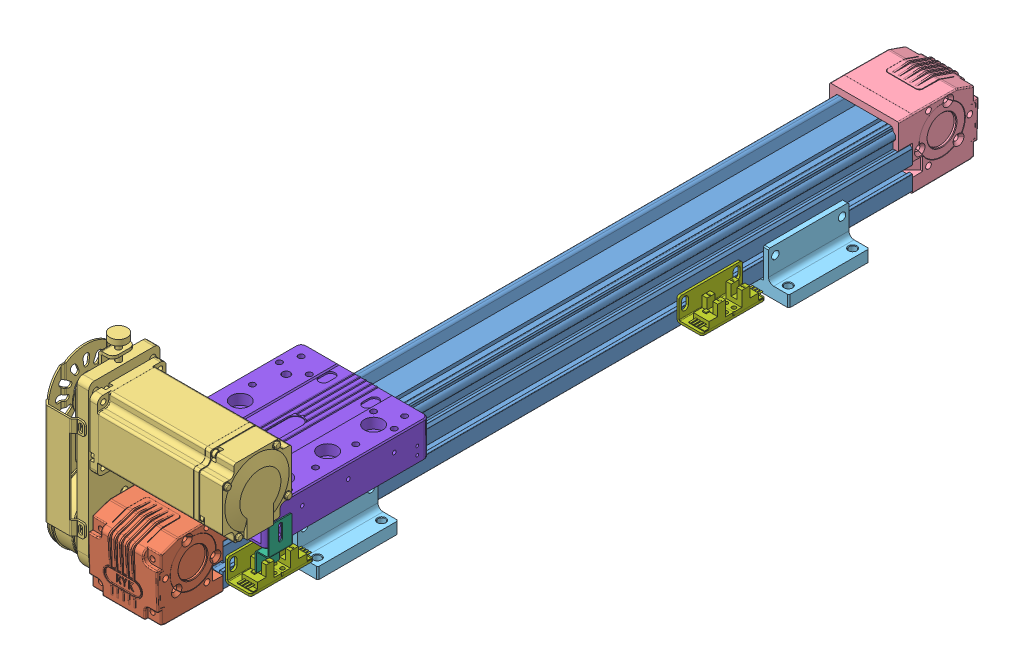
SolidWorks assembly RYK60 转折.SLDASM, configuration 默认 (file format 9000). Lengths in mm.
Overall size (155 186 720.94).
15 component instances, 10 part files, 54 mates.
Components (placement in the parent):
- RYK60欧规型材底座-1: RYK60欧规型材底座.SLDPRT [默认] at (-159.0283 -113.0298 330) size (60 54 600)
- RYK60 欧规主同步轮-1A出轴-1: RYK60 欧规主同步轮-1A出轴.SLDPRT [默认] at (-32.3208 7.4073 1260) x (-1 0 0) z (0 0 -1) size (88.36 61.19 71.44)
- RYK60欧规轻载皮带直线模组（400W电机转折配件组件）-1: RYK60欧规轻载皮带直线模组（400W电机转折配件组件）.SLDPRT [默认] at (-41.9406 57.8516 956) x (0 0 -1) z (1 0 0) size (71 173 155)
- RYK60 欧规主同步轮-2B出轴-1: RYK60 欧规主同步轮-2B出轴.SLDPRT [默认] at (-32.3208 7.4073 1260) x (-1 0 0) z (0 0 -1) (suppressed, hidden)
- RYK60欧规轻载皮带直线模组（400W电机转折配件组件）-2: RYK60欧规轻载皮带直线模组（400W电机转折配件组件）.SLDPRT [默认] at (38.0594 57.8516 956) x (0 0 1) z (-1 0 0) size (71 173 155) (suppressed, hidden)
- RYK60 欧规主同步轮-双出轴-1: RYK60 欧规主同步轮-双出轴.SLDPRT [默认] at (-32.3208 7.4073 1260) x (-1 0 0) z (0 0 -1) (suppressed, hidden)
- RYK60欧规轻载皮带直线模组（400W电机转折配件组件）-3: RYK60欧规轻载皮带直线模组（400W电机转折配件组件）.SLDPRT [默认] at (38.0594 57.8516 956) x (0 0 1) z (-1 0 0) size (71 173 155) (suppressed, hidden)
- RYK60欧规轻载皮带直线模组（400W电机转折配件组件）-4: RYK60欧规轻载皮带直线模组（400W电机转折配件组件）.SLDPRT [默认] at (-41.9406 57.8516 956) x (0 0 -1) z (1 0 0) size (71 173 155) (suppressed, hidden)
- RYK60 欧规副同步轮座-1: RYK60 欧规副同步轮座.SLDPRT [默认] at (28.4396 7.4073 0) size (60.72 61.19 71.44)
- RYK60安装底座-1: RYK60安装底座.SLDPRT [默认] at (-1.9406 -32.1484 835) size (105 36 70)
- RYK60安装底座-3: RYK60安装底座.SLDPRT [默认] at (-1.9406 -32.1484 425) size (105 36 70)
- 60欧规光电感应片-1: 60欧规光电感应片.SLDPRT [默认] at (55.0594 34.3516 897) x (0 0 1) z (-1 0 0) size (20 41 12)
- RYK60 欧规光电安装座-1: RYK60 欧规光电安装座.SLDPRT [默认] at (-32.3209 7.4073 1345.0757) x (-1 0 0) z (0 0 -1) size (22 20 55.4)
- RYK60 欧规光电安装座-2: RYK60 欧规光电安装座.SLDPRT [默认] at (-32.3209 7.4073 952.0757) x (-1 0 0) z (0 0 -1) size (22 20 55.4)
- RYK60欧规组滑块-1: RYK60欧规组滑块.SLDPRT [默认] at (-1.9406 15.3516 847) x (0 0 -1) z (1 0 0) size (142 31 112)
Mates (geometry in assembly coordinates):
- 重合1: coincident anti-aligned: plane of RYK60欧规型材底座-1 through (9.9351 -21.9484 930) normal (0 0 1); plane of RYK60 欧规主同步轮-双出轴-1 through (-31.9406 37.8516 930) normal (0 0 -1)
- 宽度1: width aligned: plane of RYK60欧规型材底座-1 through (28.0594 -20.0241 930) normal (1 0 0); plane of RYK60欧规型材底座-1 through (-31.9406 -7.4484 930) normal (-1 0 0); plane of RYK60 欧规主同步轮-双出轴-1 through (28.0594 37.8516 958) normal (1 0 0); plane of RYK60 欧规主同步轮-双出轴-1 through (-31.9406 37.8516 958) normal (-1 0 0)
- 重合4: coincident: plane of RYK60欧规型材底座-1 through (-19.8906 -22.1484 930) normal (0 -1 0); line of RYK60 欧规主同步轮-双出轴-1 through (-17.7836 -22.1484 930) axis (1 0 0)
- 重合6: coincident aligned: plane of RYK60 欧规主同步轮-2B出轴-1 through (-1.9406 -22.1484 930) normal (0 -0.999962 0.008727); plane of RYK60 欧规主同步轮-双出轴-1 through (-1.9406 -22.1484 930) normal (0 -0.999962 0.008727)
- 重合7: coincident aligned: plane of RYK60 欧规主同步轮-2B出轴-1 through (-31.9406 37.8516 930) normal (0 0 -1); plane of RYK60 欧规主同步轮-双出轴-1 through (-31.9406 37.8516 930) normal (0 0 -1)
- 重合8: coincident aligned: plane of RYK60 欧规主同步轮-2B出轴-1 through (28.0594 37.8516 958) normal (1 0 0); plane of RYK60 欧规主同步轮-双出轴-1 through (28.0594 37.8516 958) normal (1 0 0)
- 重合9: coincident anti-aligned: plane of RYK60欧规型材底座-1 through (9.9351 -21.9484 930) normal (0 0 1); plane of RYK60 欧规主同步轮-1A出轴-1 through (-31.9406 37.8516 930) normal (0 0 -1)
- 重合10: coincident aligned: plane of RYK60 欧规主同步轮-1A出轴-1 through (-1.9406 -22.1484 930) normal (0 -0.999962 0.008727); plane of RYK60 欧规主同步轮-2B出轴-1 through (-1.9406 -22.1484 930) normal (0 -0.999962 0.008727)
- 重合11: coincident aligned: plane of RYK60 欧规主同步轮-1A出轴-1 through (-31.9406 37.8516 958) normal (-1 0 0); plane of RYK60 欧规主同步轮-双出轴-1 through (-31.9406 37.8516 958) normal (-1 0 0)
- 重合12: coincident anti-aligned: plane of RYK60欧规型材底座-1 through (9.9351 -21.9484 330) normal (0 0 -1); plane of RYK60 欧规副同步轮座-1 through (28.0594 37.8516 330) normal (0 0 1)
- 宽度2: width aligned: plane of RYK60欧规型材底座-1 through (-31.9406 -7.4484 930) normal (-1 0 0); plane of RYK60欧规型材底座-1 through (28.0594 -20.0241 930) normal (1 0 0); plane of RYK60 欧规副同步轮座-1 through (-31.9406 37.8516 302) normal (-1 0 0); plane of RYK60 欧规副同步轮座-1 through (28.0594 37.8516 302) normal (1 0 0)
- 重合13: coincident: line of RYK60欧规型材底座-1 through (10.6836 -22.1484 330) axis (1 0 0); plane of RYK60 欧规副同步轮座-1 through (-1.9406 -22.1484 330) normal (0 -0.999962 -0.008727)
- 重合14: coincident anti-aligned: plane of RYK60欧规型材底座-1 through (-19.8906 -22.1484 930) normal (0 -1 0); plane of RYK60安装底座-1 through (-1.9406 -22.1484 835) normal (0 1 0)
- 宽度4: width anti-aligned: plane of RYK60安装底座-1 through (-36.6906 3.8516 800) normal (-1 0 0); plane of RYK60安装底座-1 through (32.8094 3.8516 800) normal (1 0 0); plane of RYK60欧规型材底座-1 through (28.0594 -20.0241 930) normal (1 0 0); plane of RYK60欧规型材底座-1 through (-31.9406 -7.4484 930) normal (-1 0 0)
- 距离2: distance = 60 mm aligned: plane of RYK60安装底座-1 through (-54.4406 -22.1484 870) normal (0 0 1); plane of RYK60欧规型材底座-1 through (9.9351 -21.9484 930) normal (0 0 1)
- 重合19: coincident aligned: plane of RYK60安装底座-1 through (-1.9406 -32.1484 835) normal (0 -1 0); plane of RYK60安装底座-3 through (-1.9406 -32.1484 425) normal (0 -1 0)
- 重合20: coincident aligned: plane of RYK60安装底座-1 through (-54.4406 -22.1484 800) normal (-1 0 0); plane of RYK60安装底座-3 through (-54.4406 -22.1484 390) normal (-1 0 0)
- 距离5: distance = 60 mm aligned: plane of RYK60安装底座-3 through (-54.4406 -22.1484 390) normal (0 0 -1); plane of RYK60欧规型材底座-1 through (9.9351 -21.9484 330) normal (0 0 -1)
- 重合26: coincident anti-aligned: plane of RYK60欧规型材底座-1 through (28.0594 -20.0241 930) normal (1 0 0); plane of RYK60 欧规光电安装座-1 through (28.0594 3.8516 873) normal (-1 0 0)
- 距离8: distance = 6 mm aligned: plane of RYK60 欧规光电安装座-1 through (28.0594 -16.1484 873) normal (0 -1 0); plane of RYK60欧规型材底座-1 through (23.1094 -22.1484 930) normal (0 -1 0)
- 重合30: coincident aligned: plane of RYK60 欧规光电安装座-1 through (28.0594 -16.1484 873) normal (0 -1 0); plane of RYK60 欧规光电安装座-2 through (28.0594 -16.1484 480) normal (0 -1 0)
- 重合31: coincident aligned: plane of RYK60 欧规光电安装座-1 through (30.0594 3.8516 873) normal (1 0 0); plane of RYK60 欧规光电安装座-2 through (30.0594 3.8516 480) normal (1 0 0)
- 宽度5: width anti-aligned: plane of RYK60欧规组滑块-1 through (-57.9406 46.3516 918) normal (-1 0 0); plane of RYK60欧规组滑块-1 through (54.0594 46.3516 918) normal (1 0 0); plane of RYK60欧规型材底座-1 through (28.0594 -20.0241 930) normal (1 0 0); plane of RYK60欧规型材底座-1 through (-31.9406 -7.4484 930) normal (-1 0 0)
- 距离9: distance = 78.5 mm anti-aligned: plane of RYK60欧规组滑块-1 through (-27.7335 46.3516 722.2776) normal (0 1 0); plane of RYK60安装底座-1 through (-1.9406 -32.1484 835) normal (0 -1 0)
- 重合33: coincident anti-aligned: plane of RYK60 欧规主同步轮-2B出轴-1 through (-25.1906 24.7904 918) normal (0 0 -1); plane of RYK60欧规组滑块-1 through (-57.9406 46.3516 918) normal (0 0 1)
- 重合34: coincident anti-aligned: plane of 60欧规光电感应片-1 through (54.0594 34.3516 917) normal (-1 0 0); plane of RYK60欧规组滑块-1 through (54.0594 46.3516 918) normal (1 0 0)
- 距离10: distance = 12 mm aligned: plane of 60欧规光电感应片-1 through (54.0594 34.3516 917) normal (0 1 0); plane of RYK60欧规组滑块-1 through (23.8522 46.3516 722.2776) normal (0 1 0)
- 距离11: distance = 1 mm aligned: plane of 60欧规光电感应片-1 through (44.796 8.615 917) normal (0 0 1); plane of RYK60欧规组滑块-1 through (54.0594 46.3516 918) normal (0 0 1)
- 同心1: concentric aligned: cylinder of RYK60 欧规主同步轮-双出轴-1 through (56.0594 12.8516 956) axis (-1 0 0) radius 6; cylinder of RYK60欧规轻载皮带直线模组（400W电机转折配件组件）-1 through (-31.9406 12.8516 956) axis (-1 0 0) radius 15
- 重合35: coincident anti-aligned: plane of RYK60 欧规主同步轮-双出轴-1 through (-31.9406 37.8516 958) normal (-1 0 0); plane of RYK60欧规轻载皮带直线模组（400W电机转折配件组件）-1 through (-31.9406 57.8516 956) normal (1 0 0)
- 平行1: parallel anti-aligned: plane of RYK60欧规组滑块-1 through (-27.7335 46.3516 722.2776) normal (0 1 0); plane of RYK60欧规轻载皮带直线模组（400W电机转折配件组件）-1 through (-31.9406 -17.1484 987) normal (0 -1 0)
- 重合37: coincident anti-aligned: plane of RYK60 欧规主同步轮-双出轴-1 through (28.0594 37.8516 958) normal (1 0 0); plane of RYK60欧规轻载皮带直线模组（400W电机转折配件组件）-2 through (28.0594 57.8516 956) normal (-1 0 0)
- 同心2: concentric anti-aligned: cylinder of RYK60 欧规主同步轮-双出轴-1 through (56.0594 12.8516 956) axis (-1 0 0) radius 6; cylinder of RYK60欧规轻载皮带直线模组（400W电机转折配件组件）-2 through (28.0594 12.8516 956) axis (1 0 0) radius 15
- 平行2: parallel aligned: plane of RYK60欧规组滑块-1 through (23.8522 46.3516 722.2776) normal (0 1 0); plane of RYK60欧规轻载皮带直线模组（400W电机转折配件组件）-2 through (28.0594 132.8516 925) normal (0 1 0)
- 距离12: distance = 2 mm aligned: plane of RYK60 欧规光电安装座-1 through (30.796 -13.4118 928) normal (0 0 1); plane of RYK60欧规型材底座-1 through (9.9351 -21.9484 930) normal (0 0 1)
- 距离13: distance = 150 mm aligned: plane of RYK60 欧规光电安装座-2 through (30.796 -13.4118 480) normal (0 0 -1); plane of RYK60欧规型材底座-1 through (9.9351 -21.9484 330) normal (0 0 -1)
- 同心3: concentric anti-aligned: cylinder of RYK60 欧规主同步轮-2B出轴-1 through (56.0594 12.8516 956) axis (-1 0 0) radius 6; cylinder of RYK60欧规轻载皮带直线模组（400W电机转折配件组件）-2 through (28.0594 12.8516 956) axis (1 0 0) radius 15
- 重合38: coincident anti-aligned: plane of RYK60 欧规主同步轮-2B出轴-1 through (28.0594 37.8516 958) normal (1 0 0); plane of RYK60欧规轻载皮带直线模组（400W电机转折配件组件）-2 through (28.0594 57.8516 956) normal (-1 0 0)
- 同心4: concentric aligned: cylinder of RYK60欧规型材底座-1 through (21.3094 24.8516 941.3137) axis (0 0 -1) radius 4; circle of RYK60 欧规主同步轮-2B出轴-1
- 重合40: coincident anti-aligned: plane of RYK60欧规型材底座-1 through (9.9351 -21.9484 930) normal (0 0 1); plane of RYK60 欧规主同步轮-2B出轴-1 through (-31.9406 37.8516 930) normal (0 0 -1)
- 重合42: coincident anti-aligned: plane of RYK60欧规型材底座-1 through (9.9351 -21.9484 930) normal (0 0 1); plane of RYK60 欧规主同步轮-1A出轴-1 through (-31.9406 37.8516 930) normal (0 0 -1)
- 宽度6: width anti-aligned: plane of RYK60欧规型材底座-1 through (-31.9406 -7.4484 930) normal (-1 0 0); plane of RYK60欧规型材底座-1 through (28.0594 -20.0241 930) normal (1 0 0); plane of RYK60 欧规主同步轮-1A出轴-1 through (28.0594 37.8516 958) normal (1 0 0); plane of RYK60 欧规主同步轮-1A出轴-1 through (-31.9406 37.8516 958) normal (-1 0 0)
- 同心5: concentric anti-aligned: cylinder of RYK60欧规型材底座-1 through (21.3094 24.8516 941.3137) axis (0 0 -1) radius 4; cone of RYK60 欧规主同步轮-1A出轴-1 through (21.3094 24.8516 930) axis (0 0 1)
- 同心6: concentric aligned: cylinder of RYK60 欧规主同步轮-1A出轴-1 through (56.0594 12.8516 956) axis (-1 0 0) radius 6; cylinder of RYK60欧规轻载皮带直线模组（400W电机转折配件组件）-1 through (-31.9406 12.8516 956) axis (-1 0 0) radius 15
- 重合44: coincident anti-aligned: plane of RYK60 欧规主同步轮-1A出轴-1 through (-31.9406 37.8516 958) normal (-1 0 0); plane of RYK60欧规轻载皮带直线模组（400W电机转折配件组件）-1 through (-31.9406 57.8516 956) normal (1 0 0)
- 平行4: parallel aligned: plane of RYK60欧规轻载皮带直线模组（400W电机转折配件组件）-1 through (-25.4406 124.8516 931) normal (0 1 0); plane of RYK60欧规组滑块-1 through (23.8522 46.3516 722.2776) normal (0 1 0)
- 重合46: coincident anti-aligned: plane of RYK60 欧规主同步轮-1A出轴-1 through (-25.1906 24.7904 918) normal (0 0 -1); plane of RYK60欧规组滑块-1 through (-57.9406 46.3516 918) normal (0 0 1)
- 重合47: coincident anti-aligned: plane of RYK60 欧规主同步轮-双出轴-1 through (-25.1906 24.7904 918) normal (0 0 -1); plane of RYK60欧规组滑块-1 through (-57.9406 46.3516 918) normal (0 0 1)
- 同心7: concentric aligned: cylinder of RYK60 欧规主同步轮-双出轴-1 through (56.0594 12.8516 956) axis (-1 0 0) radius 6; cylinder of RYK60欧规轻载皮带直线模组（400W电机转折配件组件）-4 through (-31.9406 12.8516 956) axis (-1 0 0) radius 15
- 重合48: coincident anti-aligned: plane of RYK60 欧规主同步轮-双出轴-1 through (-31.9406 37.8516 958) normal (-1 0 0); plane of RYK60欧规轻载皮带直线模组（400W电机转折配件组件）-4 through (-31.9406 57.8516 956) normal (1 0 0)
- 平行5: parallel aligned: plane of RYK60欧规组滑块-1 through (-27.7335 46.3516 722.2776) normal (0 1 0); plane of RYK60欧规轻载皮带直线模组（400W电机转折配件组件）-4 through (-31.9406 132.8516 987) normal (0 1 0)
- 同心8: concentric anti-aligned: cylinder of RYK60 欧规主同步轮-双出轴-1 through (56.0594 12.8516 956) axis (-1 0 0) radius 6; cylinder of RYK60欧规轻载皮带直线模组（400W电机转折配件组件）-3 through (28.0594 12.8516 956) axis (1 0 0) radius 15
- 重合50: coincident anti-aligned: plane of RYK60 欧规主同步轮-双出轴-1 through (28.0594 37.8516 958) normal (1 0 0); plane of RYK60欧规轻载皮带直线模组（400W电机转折配件组件）-3 through (28.0594 57.8516 956) normal (-1 0 0)
- 平行6: parallel aligned: plane of RYK60欧规组滑块-1 through (23.8522 46.3516 722.2776) normal (0 1 0); plane of RYK60欧规轻载皮带直线模组（400W电机转折配件组件）-3 through (21.5594 124.8516 981) normal (0 1 0)
